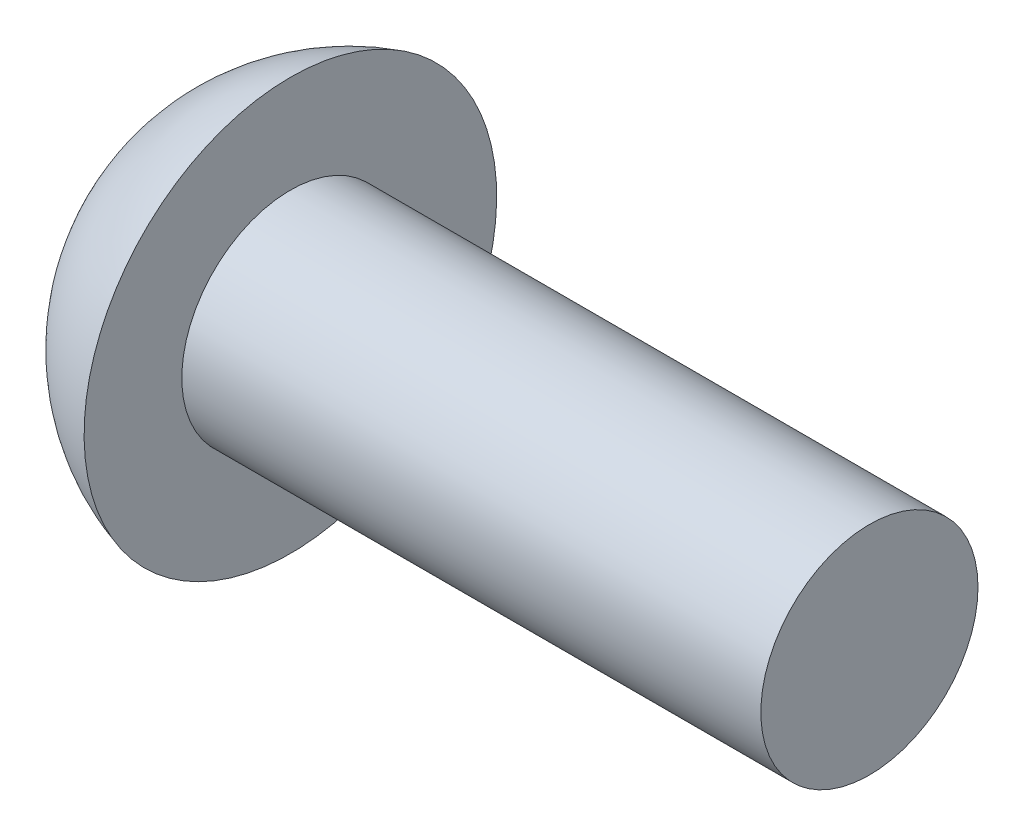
ISO-10303-21;
HEADER;
FILE_DESCRIPTION(('STEP AP214'),'2;1');
FILE_NAME('part.step','',(''),(''),'','','');
FILE_SCHEMA(('AUTOMOTIVE_DESIGN { 1 0 10303 214 1 1 1 1 }'));
ENDSEC;
DATA;
#1=APPLICATION_CONTEXT('core data for automotive mechanical design processes');
#2=APPLICATION_PROTOCOL_DEFINITION('international standard','automotive_design',2000,#1);
#3=PRODUCT_CONTEXT('',#1,'mechanical');
#4=PRODUCT('Part','Part','',(#3));
#5=PRODUCT_RELATED_PRODUCT_CATEGORY('part','',(#4));
#6=PRODUCT_DEFINITION_FORMATION('','',#4);
#7=PRODUCT_DEFINITION_CONTEXT('part definition',#1,'design');
#8=PRODUCT_DEFINITION('design','',#6,#7);
#9=PRODUCT_DEFINITION_SHAPE('','',#8);
#10=(LENGTH_UNIT() NAMED_UNIT(*) SI_UNIT(.MILLI.,.METRE.));
#11=(NAMED_UNIT(*) PLANE_ANGLE_UNIT() SI_UNIT($,.RADIAN.));
#12=(NAMED_UNIT(*) SI_UNIT($,.STERADIAN.) SOLID_ANGLE_UNIT());
#13=UNCERTAINTY_MEASURE_WITH_UNIT(LENGTH_MEASURE(1.E-05),#10,'distance_accuracy_value','');
#14=(GEOMETRIC_REPRESENTATION_CONTEXT(3) GLOBAL_UNCERTAINTY_ASSIGNED_CONTEXT((#13)) GLOBAL_UNIT_ASSIGNED_CONTEXT((#10,
#11,#12)) REPRESENTATION_CONTEXT('',''));
#15=CARTESIAN_POINT('',(0.,0.,0.));
#16=DIRECTION('',(0.,0.,1.));
#17=DIRECTION('',(1.,0.,0.));
#18=AXIS2_PLACEMENT_3D('',#15,#16,#17);
#19=CARTESIAN_POINT('',(0.,0.,0.));
#20=DIRECTION('',(1.,0.,0.));
#21=DIRECTION('',(0.,0.,-1.));
#22=AXIS2_PLACEMENT_3D('',#19,#20,#21);
#23=PLANE('',#22);
#24=CARTESIAN_POINT('',(0.,0.,0.));
#25=DIRECTION('',(-1.,0.,0.));
#26=DIRECTION('',(0.,0.,1.));
#27=AXIS2_PLACEMENT_3D('',#24,#25,#26);
#28=CIRCLE('',#27,1.65);
#29=CARTESIAN_POINT('',(0.,1.65,0.));
#30=VERTEX_POINT('',#29);
#31=EDGE_CURVE('E104',#30,#30,#28,.T.);
#32=ORIENTED_EDGE('',*,*,#31,.T.);
#33=EDGE_LOOP('',(#32));
#34=FACE_BOUND('',#33,.T.);
#35=DIRECTION('',(0.,0.866025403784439,-0.5));
#36=VECTOR('',#35,1.);
#37=CARTESIAN_POINT('',(0.,-1.,-0.57735026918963));
#38=LINE('',#37,#36);
#39=CARTESIAN_POINT('',(0.,-1.,-0.57735026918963));
#40=VERTEX_POINT('',#39);
#41=CARTESIAN_POINT('',(0.,0.,-1.15470053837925));
#42=VERTEX_POINT('',#41);
#43=EDGE_CURVE('E30',#40,#42,#38,.T.);
#44=ORIENTED_EDGE('',*,*,#43,.T.);
#45=DIRECTION('',(0.,0.866025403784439,0.5));
#46=VECTOR('',#45,1.);
#47=CARTESIAN_POINT('',(0.,0.,-1.15470053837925));
#48=LINE('',#47,#46);
#49=CARTESIAN_POINT('',(0.,1.,-0.577350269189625));
#50=VERTEX_POINT('',#49);
#51=EDGE_CURVE('E89',#42,#50,#48,.T.);
#52=ORIENTED_EDGE('',*,*,#51,.T.);
#53=DIRECTION('',(0.,0.,1.));
#54=VECTOR('',#53,1.);
#55=CARTESIAN_POINT('',(0.,1.,-0.577350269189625));
#56=LINE('',#55,#54);
#57=CARTESIAN_POINT('',(0.,1.,0.577350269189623));
#58=VERTEX_POINT('',#57);
#59=EDGE_CURVE('E87',#50,#58,#56,.T.);
#60=ORIENTED_EDGE('',*,*,#59,.T.);
#61=DIRECTION('',(0.,-0.866025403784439,0.5));
#62=VECTOR('',#61,1.);
#63=CARTESIAN_POINT('',(0.,1.,0.577350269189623));
#64=LINE('',#63,#62);
#65=CARTESIAN_POINT('',(0.,0.,1.15470053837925));
#66=VERTEX_POINT('',#65);
#67=EDGE_CURVE('E66',#58,#66,#64,.T.);
#68=ORIENTED_EDGE('',*,*,#67,.T.);
#69=DIRECTION('',(0.,-0.866025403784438,-0.5));
#70=VECTOR('',#69,1.);
#71=CARTESIAN_POINT('',(0.,0.,1.15470053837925));
#72=LINE('',#71,#70);
#73=CARTESIAN_POINT('',(0.,-1.,0.577350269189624));
#74=VERTEX_POINT('',#73);
#75=EDGE_CURVE('E77',#66,#74,#72,.T.);
#76=ORIENTED_EDGE('',*,*,#75,.T.);
#77=DIRECTION('',(0.,0.,-1.));
#78=VECTOR('',#77,1.);
#79=CARTESIAN_POINT('',(0.,-1.,0.577350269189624));
#80=LINE('',#79,#78);
#81=EDGE_CURVE('E83',#74,#40,#80,.T.);
#82=ORIENTED_EDGE('',*,*,#81,.T.);
#83=EDGE_LOOP('',(#44,#52,#60,#68,#76,#82));
#84=FACE_BOUND('',#83,.T.);
#85=ADVANCED_FACE('F16',(#34,#84),#23,.F.);
#86=CARTESIAN_POINT('',(1.65,0.,0.));
#87=DIRECTION('',(1.,0.,0.));
#88=DIRECTION('',(0.,0.,-1.));
#89=AXIS2_PLACEMENT_3D('',#86,#87,#88);
#90=PLANE('',#89);
#91=CARTESIAN_POINT('',(1.65,0.,0.));
#92=DIRECTION('',(-1.,0.,0.));
#93=DIRECTION('',(0.,0.,1.));
#94=AXIS2_PLACEMENT_3D('',#91,#92,#93);
#95=CIRCLE('',#94,2.85);
#96=CARTESIAN_POINT('',(1.65,2.85,0.));
#97=VERTEX_POINT('',#96);
#98=EDGE_CURVE('E107',#97,#97,#95,.T.);
#99=ORIENTED_EDGE('',*,*,#98,.F.);
#100=EDGE_LOOP('',(#99));
#101=FACE_BOUND('',#100,.T.);
#102=CARTESIAN_POINT('',(1.65,0.,0.));
#103=DIRECTION('',(1.,0.,0.));
#104=DIRECTION('',(0.,0.,-1.));
#105=AXIS2_PLACEMENT_3D('',#102,#103,#104);
#106=CIRCLE('',#105,1.5);
#107=CARTESIAN_POINT('',(1.65,0.,-1.5));
#108=VERTEX_POINT('',#107);
#109=EDGE_CURVE('E19',#108,#108,#106,.T.);
#110=ORIENTED_EDGE('',*,*,#109,.F.);
#111=EDGE_LOOP('',(#110));
#112=FACE_BOUND('',#111,.T.);
#113=ADVANCED_FACE('F120',(#101,#112),#90,.T.);
#114=CARTESIAN_POINT('',(9.65,0.,0.));
#115=DIRECTION('',(-1.,0.,0.));
#116=DIRECTION('',(0.,0.,1.));
#117=AXIS2_PLACEMENT_3D('',#114,#115,#116);
#118=CYLINDRICAL_SURFACE('',#117,1.5);
#119=CARTESIAN_POINT('',(9.65,0.,0.));
#120=DIRECTION('',(1.,0.,0.));
#121=DIRECTION('',(0.,0.,-1.));
#122=AXIS2_PLACEMENT_3D('',#119,#120,#121);
#123=CIRCLE('',#122,1.5);
#124=CARTESIAN_POINT('',(9.65,0.,-1.5));
#125=VERTEX_POINT('',#124);
#126=EDGE_CURVE('E11',#125,#125,#123,.T.);
#127=ORIENTED_EDGE('',*,*,#126,.F.);
#128=EDGE_LOOP('',(#127));
#129=FACE_BOUND('',#128,.T.);
#130=ORIENTED_EDGE('',*,*,#109,.T.);
#131=EDGE_LOOP('',(#130));
#132=FACE_BOUND('',#131,.T.);
#133=ADVANCED_FACE('F118',(#129,#132),#118,.T.);
#134=CARTESIAN_POINT('',(9.65,0.,0.));
#135=DIRECTION('',(1.,0.,0.));
#136=DIRECTION('',(0.,0.,-1.));
#137=AXIS2_PLACEMENT_3D('',#134,#135,#136);
#138=PLANE('',#137);
#139=ORIENTED_EDGE('',*,*,#126,.T.);
#140=EDGE_LOOP('',(#139));
#141=FACE_BOUND('',#140,.T.);
#142=ADVANCED_FACE('F128',(#141),#138,.T.);
#143=CARTESIAN_POINT('',(2.46136363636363,0.,0.));
#144=DIRECTION('',(-1.,0.,0.));
#145=DIRECTION('',(0.,1.,0.));
#146=AXIS2_PLACEMENT_3D('',#143,#144,#145);
#147=SPHERICAL_SURFACE('',#146,2.96324331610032);
#148=CARTESIAN_POINT('',(1.65,2.85,0.));
#149=CARTESIAN_POINT('',(1.6291329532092,2.84405942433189,0.));
#150=CARTESIAN_POINT('',(1.60833117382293,2.83788959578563,0.));
#151=CARTESIAN_POINT('',(1.56686813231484,2.82509458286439,0.));
#152=CARTESIAN_POINT('',(1.54620687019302,2.81846939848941,0.));
#153=CARTESIAN_POINT('',(1.50503484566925,2.80476682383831,0.));
#154=CARTESIAN_POINT('',(1.48452408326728,2.79768943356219,0.));
#155=CARTESIAN_POINT('',(1.44366294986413,2.78308587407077,0.));
#156=CARTESIAN_POINT('',(1.42331257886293,2.77555970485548,0.));
#157=CARTESIAN_POINT('',(1.38278204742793,2.7600622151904,0.));
#158=CARTESIAN_POINT('',(1.36260188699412,2.75209089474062,0.));
#159=CARTESIAN_POINT('',(1.32242151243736,2.73570694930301,0.));
#160=CARTESIAN_POINT('',(1.30242129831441,2.72729432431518,0.));
#161=CARTESIAN_POINT('',(1.26261046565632,2.71003182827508,0.));
#162=CARTESIAN_POINT('',(1.24279984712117,2.70118195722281,0.));
#163=CARTESIAN_POINT('',(1.20337776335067,2.68304923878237,0.));
#164=CARTESIAN_POINT('',(1.1837662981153,2.67376639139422,0.));
#165=CARTESIAN_POINT('',(1.1447519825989,2.65477219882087,0.));
#166=CARTESIAN_POINT('',(1.12534913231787,2.64506085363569,0.));
#167=CARTESIAN_POINT('',(1.08676140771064,2.62521435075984,0.));
#168=CARTESIAN_POINT('',(1.06757653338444,2.61507919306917,0.));
#169=CARTESIAN_POINT('',(1.02943401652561,2.59438995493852,0.));
#170=CARTESIAN_POINT('',(1.01047637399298,2.58383587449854,0.));
#171=CARTESIAN_POINT('',(0.972797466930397,2.56231388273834,0.));
#172=CARTESIAN_POINT('',(0.95407620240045,2.55134597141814,0.));
#173=CARTESIAN_POINT('',(0.916879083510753,2.52900160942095,0.));
#174=CARTESIAN_POINT('',(0.898403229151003,2.51762515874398,0.));
#175=CARTESIAN_POINT('',(0.861705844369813,2.49446920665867,0.));
#176=CARTESIAN_POINT('',(0.843484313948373,2.48268970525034,0.));
#177=CARTESIAN_POINT('',(0.807304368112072,2.45873333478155,0.));
#178=CARTESIAN_POINT('',(0.789345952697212,2.44655646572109,0.));
#179=CARTESIAN_POINT('',(0.75370090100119,2.42181123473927,0.));
#180=CARTESIAN_POINT('',(0.736014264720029,2.40924287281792,0.));
#181=CARTESIAN_POINT('',(0.700921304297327,2.38372071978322,0.));
#182=CARTESIAN_POINT('',(0.683514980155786,2.37076692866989,0.));
#183=CARTESIAN_POINT('',(0.648991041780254,2.3444801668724,0.));
#184=CARTESIAN_POINT('',(0.631873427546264,2.33114719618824,0.));
#185=CARTESIAN_POINT('',(0.59793516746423,2.30410850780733,0.));
#186=CARTESIAN_POINT('',(0.581114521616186,2.29040279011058,0.));
#187=CARTESIAN_POINT('',(0.547778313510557,2.26262522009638,0.));
#188=CARTESIAN_POINT('',(0.53126275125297,2.24855336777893,0.));
#189=CARTESIAN_POINT('',(0.49854467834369,2.22005031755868,0.));
#190=CARTESIAN_POINT('',(0.482342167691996,2.20561911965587,0.));
#191=CARTESIAN_POINT('',(0.450258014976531,2.17640434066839,0.));
#192=CARTESIAN_POINT('',(0.43437637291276,2.16162075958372,0.));
#193=CARTESIAN_POINT('',(0.402941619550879,2.13170834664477,0.));
#194=CARTESIAN_POINT('',(0.387388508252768,2.11657951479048,0.));
#195=CARTESIAN_POINT('',(0.356618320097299,2.08598389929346,0.));
#196=CARTESIAN_POINT('',(0.341401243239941,2.07051711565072,0.));
#197=CARTESIAN_POINT('',(0.311310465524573,2.03925305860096,0.));
#198=CARTESIAN_POINT('',(0.296436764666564,2.02345578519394,0.));
#199=CARTESIAN_POINT('',(0.267039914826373,1.99153837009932,0.));
#200=CARTESIAN_POINT('',(0.252516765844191,1.97541822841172,0.));
#201=CARTESIAN_POINT('',(0.223828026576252,1.94286285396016,0.));
#202=CARTESIAN_POINT('',(0.209662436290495,1.9264276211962,0.));
#203=CARTESIAN_POINT('',(0.1816956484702,1.89324999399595,0.));
#204=CARTESIAN_POINT('',(0.167894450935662,1.87650759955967,0.));
#205=CARTESIAN_POINT('',(0.14066310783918,1.84272372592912,0.));
#206=CARTESIAN_POINT('',(0.127232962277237,1.82568224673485,0.));
#207=CARTESIAN_POINT('',(0.100750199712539,1.79130842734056,0.));
#208=CARTESIAN_POINT('',(0.0876975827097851,1.77397608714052,0.));
#209=CARTESIAN_POINT('',(0.0619761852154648,1.73902890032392,0.));
#210=CARTESIAN_POINT('',(0.0493074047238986,1.72141405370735,0.));
#211=CARTESIAN_POINT('',(0.0243597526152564,1.68591038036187,0.));
#212=CARTESIAN_POINT('',(0.0120808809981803,1.66802155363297,0.));
#213=CARTESIAN_POINT('',(0.,1.65,0.));
#214=B_SPLINE_CURVE_WITH_KNOTS('',3,(#148,#149,#150,#151,#152,#153,#154,#155,#156,#157,#158,
#159,#160,#161,#162,#163,#164,#165,#166,#167,#168,#169,#170,#171,#172,#173,#174,#175,#176,#177,
#178,#179,#180,#181,#182,#183,#184,#185,#186,#187,#188,#189,#190,#191,#192,#193,#194,#195,#196,
#197,#198,#199,#200,#201,#202,#203,#204,#205,#206,#207,#208,#209,#210,#211,#212,#213),
.UNSPECIFIED.,.F.,.F.,(4,2,2,2,2,2,2,2,2,2,2,2,2,2,2,2,2,2,2,2,2,2,2,2,2,2,2,2,2,2,2,2,4),(0.,
0.0650872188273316,0.130174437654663,0.195261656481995,0.260348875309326,0.325436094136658,
0.390523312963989,0.455610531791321,0.520697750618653,0.585784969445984,0.650872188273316,
0.715959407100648,0.781046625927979,0.846133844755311,0.911221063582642,0.976308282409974,
1.04139550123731,1.10648272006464,1.17156993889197,1.2366571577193,1.30174437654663,
1.36683159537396,1.4319188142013,1.49700603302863,1.56209325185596,1.62718047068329,
1.69226768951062,1.75735490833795,1.82244212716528,1.88752934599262,1.95261656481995,
2.01770378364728,2.08279100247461),.UNSPECIFIED.);
#215=EDGE_CURVE('BSEAM135',#97,#30,#214,.T.);
#216=ORIENTED_EDGE('',*,*,#98,.T.);
#217=ORIENTED_EDGE('',*,*,#31,.F.);
#218=ORIENTED_EDGE('',*,*,#215,.T.);
#219=ORIENTED_EDGE('',*,*,#215,.F.);
#220=EDGE_LOOP('',(#216,#218,#217,#219));
#221=FACE_BOUND('',#220,.T.);
#222=ADVANCED_FACE('F135',(#221),#147,.T.);
#223=CARTESIAN_POINT('',(1.04,-1.,-0.57735026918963));
#224=DIRECTION('',(0.,0.5,0.866025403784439));
#225=DIRECTION('',(0.,-0.866025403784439,0.5));
#226=AXIS2_PLACEMENT_3D('',#223,#224,#225);
#227=PLANE('',#226);
#228=ORIENTED_EDGE('',*,*,#43,.F.);
#229=DIRECTION('',(-1.,0.,0.));
#230=VECTOR('',#229,1.);
#231=CARTESIAN_POINT('',(1.04,-1.,-0.57735026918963));
#232=LINE('',#231,#230);
#233=CARTESIAN_POINT('',(1.04,-1.,-0.57735026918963));
#234=VERTEX_POINT('',#233);
#235=EDGE_CURVE('E95',#234,#40,#232,.T.);
#236=ORIENTED_EDGE('',*,*,#235,.F.);
#237=DIRECTION('',(0.,0.866025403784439,-0.5));
#238=VECTOR('',#237,1.);
#239=CARTESIAN_POINT('',(1.04,-1.,-0.57735026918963));
#240=LINE('',#239,#238);
#241=CARTESIAN_POINT('',(1.04,0.,-1.15470053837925));
#242=VERTEX_POINT('',#241);
#243=EDGE_CURVE('E94',#234,#242,#240,.T.);
#244=ORIENTED_EDGE('',*,*,#243,.T.);
#245=DIRECTION('',(-1.,0.,0.));
#246=VECTOR('',#245,1.);
#247=CARTESIAN_POINT('',(1.04,0.,-1.15470053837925));
#248=LINE('',#247,#246);
#249=EDGE_CURVE('E102',#242,#42,#248,.T.);
#250=ORIENTED_EDGE('',*,*,#249,.T.);
#251=EDGE_LOOP('',(#228,#236,#244,#250));
#252=FACE_BOUND('',#251,.T.);
#253=ADVANCED_FACE('F139',(#252),#227,.T.);
#254=CARTESIAN_POINT('',(1.04,0.,-1.15470053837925));
#255=DIRECTION('',(0.,-0.5,0.866025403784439));
#256=DIRECTION('',(0.,-0.866025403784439,-0.5));
#257=AXIS2_PLACEMENT_3D('',#254,#255,#256);
#258=PLANE('',#257);
#259=ORIENTED_EDGE('',*,*,#51,.F.);
#260=ORIENTED_EDGE('',*,*,#249,.F.);
#261=DIRECTION('',(0.,0.866025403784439,0.5));
#262=VECTOR('',#261,1.);
#263=CARTESIAN_POINT('',(1.04,0.,-1.15470053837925));
#264=LINE('',#263,#262);
#265=CARTESIAN_POINT('',(1.04,1.,-0.577350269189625));
#266=VERTEX_POINT('',#265);
#267=EDGE_CURVE('E210',#242,#266,#264,.T.);
#268=ORIENTED_EDGE('',*,*,#267,.T.);
#269=DIRECTION('',(-1.,0.,0.));
#270=VECTOR('',#269,1.);
#271=CARTESIAN_POINT('',(1.04,1.,-0.577350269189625));
#272=LINE('',#271,#270);
#273=EDGE_CURVE('E100',#266,#50,#272,.T.);
#274=ORIENTED_EDGE('',*,*,#273,.T.);
#275=EDGE_LOOP('',(#259,#260,#268,#274));
#276=FACE_BOUND('',#275,.T.);
#277=ADVANCED_FACE('F142',(#276),#258,.T.);
#278=CARTESIAN_POINT('',(1.04,1.,-0.577350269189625));
#279=DIRECTION('',(0.,-1.,0.));
#280=DIRECTION('',(0.,0.,-1.));
#281=AXIS2_PLACEMENT_3D('',#278,#279,#280);
#282=PLANE('',#281);
#283=ORIENTED_EDGE('',*,*,#59,.F.);
#284=ORIENTED_EDGE('',*,*,#273,.F.);
#285=DIRECTION('',(0.,0.,1.));
#286=VECTOR('',#285,1.);
#287=CARTESIAN_POINT('',(1.04,1.,-0.577350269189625));
#288=LINE('',#287,#286);
#289=CARTESIAN_POINT('',(1.04,1.,0.577350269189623));
#290=VERTEX_POINT('',#289);
#291=EDGE_CURVE('E39',#266,#290,#288,.T.);
#292=ORIENTED_EDGE('',*,*,#291,.T.);
#293=DIRECTION('',(-1.,0.,0.));
#294=VECTOR('',#293,1.);
#295=CARTESIAN_POINT('',(1.04,1.,0.577350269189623));
#296=LINE('',#295,#294);
#297=EDGE_CURVE('E73',#290,#58,#296,.T.);
#298=ORIENTED_EDGE('',*,*,#297,.T.);
#299=EDGE_LOOP('',(#283,#284,#292,#298));
#300=FACE_BOUND('',#299,.T.);
#301=ADVANCED_FACE('F145',(#300),#282,.T.);
#302=CARTESIAN_POINT('',(1.04,1.,0.577350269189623));
#303=DIRECTION('',(0.,-0.5,-0.866025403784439));
#304=DIRECTION('',(0.,0.866025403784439,-0.5));
#305=AXIS2_PLACEMENT_3D('',#302,#303,#304);
#306=PLANE('',#305);
#307=ORIENTED_EDGE('',*,*,#67,.F.);
#308=ORIENTED_EDGE('',*,*,#297,.F.);
#309=DIRECTION('',(0.,-0.866025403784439,0.5));
#310=VECTOR('',#309,1.);
#311=CARTESIAN_POINT('',(1.04,1.,0.577350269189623));
#312=LINE('',#311,#310);
#313=CARTESIAN_POINT('',(1.04,0.,1.15470053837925));
#314=VERTEX_POINT('',#313);
#315=EDGE_CURVE('E70',#290,#314,#312,.T.);
#316=ORIENTED_EDGE('',*,*,#315,.T.);
#317=DIRECTION('',(-1.,0.,0.));
#318=VECTOR('',#317,1.);
#319=CARTESIAN_POINT('',(1.04,0.,1.15470053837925));
#320=LINE('',#319,#318);
#321=EDGE_CURVE('E61',#314,#66,#320,.T.);
#322=ORIENTED_EDGE('',*,*,#321,.T.);
#323=EDGE_LOOP('',(#307,#308,#316,#322));
#324=FACE_BOUND('',#323,.T.);
#325=ADVANCED_FACE('F63',(#324),#306,.T.);
#326=CARTESIAN_POINT('',(1.04,0.,1.15470053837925));
#327=DIRECTION('',(0.,0.5,-0.866025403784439));
#328=DIRECTION('',(0.,0.866025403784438,0.5));
#329=AXIS2_PLACEMENT_3D('',#326,#327,#328);
#330=PLANE('',#329);
#331=ORIENTED_EDGE('',*,*,#75,.F.);
#332=ORIENTED_EDGE('',*,*,#321,.F.);
#333=DIRECTION('',(0.,-0.866025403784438,-0.5));
#334=VECTOR('',#333,1.);
#335=CARTESIAN_POINT('',(1.04,0.,1.15470053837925));
#336=LINE('',#335,#334);
#337=CARTESIAN_POINT('',(1.04,-1.,0.577350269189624));
#338=VERTEX_POINT('',#337);
#339=EDGE_CURVE('E185',#314,#338,#336,.T.);
#340=ORIENTED_EDGE('',*,*,#339,.T.);
#341=DIRECTION('',(-1.,0.,0.));
#342=VECTOR('',#341,1.);
#343=CARTESIAN_POINT('',(1.04,-1.,0.577350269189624));
#344=LINE('',#343,#342);
#345=EDGE_CURVE('E74',#338,#74,#344,.T.);
#346=ORIENTED_EDGE('',*,*,#345,.T.);
#347=EDGE_LOOP('',(#331,#332,#340,#346));
#348=FACE_BOUND('',#347,.T.);
#349=ADVANCED_FACE('F78',(#348),#330,.T.);
#350=CARTESIAN_POINT('',(1.04,-1.,0.577350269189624));
#351=DIRECTION('',(0.,1.,0.));
#352=DIRECTION('',(0.,0.,1.));
#353=AXIS2_PLACEMENT_3D('',#350,#351,#352);
#354=PLANE('',#353);
#355=ORIENTED_EDGE('',*,*,#81,.F.);
#356=ORIENTED_EDGE('',*,*,#345,.F.);
#357=DIRECTION('',(0.,0.,-1.));
#358=VECTOR('',#357,1.);
#359=CARTESIAN_POINT('',(1.04,-1.,0.577350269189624));
#360=LINE('',#359,#358);
#361=EDGE_CURVE('E97',#338,#234,#360,.T.);
#362=ORIENTED_EDGE('',*,*,#361,.T.);
#363=ORIENTED_EDGE('',*,*,#235,.T.);
#364=EDGE_LOOP('',(#355,#356,#362,#363));
#365=FACE_BOUND('',#364,.T.);
#366=ADVANCED_FACE('F154',(#365),#354,.T.);
#367=CARTESIAN_POINT('',(1.04,0.,1.15470053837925));
#368=DIRECTION('',(0.86602540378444,-0.25,0.433012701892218));
#369=DIRECTION('',(0.447213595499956,0.,-0.894427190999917));
#370=AXIS2_PLACEMENT_3D('',#367,#368,#369);
#371=PLANE('',#370);
#372=ORIENTED_EDGE('',*,*,#339,.F.);
#373=DIRECTION('',(-0.447213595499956,0.,0.894427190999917));
#374=VECTOR('',#373,1.);
#375=CARTESIAN_POINT('',(1.04,0.,1.15470053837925));
#376=LINE('',#375,#374);
#377=CARTESIAN_POINT('',(1.61735026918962,0.,0.));
#378=VERTEX_POINT('',#377);
#379=EDGE_CURVE('E187',#378,#314,#376,.T.);
#380=ORIENTED_EDGE('',*,*,#379,.F.);
#381=DIRECTION('',(-0.447213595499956,-0.774596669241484,0.447213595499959));
#382=VECTOR('',#381,1.);
#383=CARTESIAN_POINT('',(1.04,-1.,0.577350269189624));
#384=LINE('',#383,#382);
#385=EDGE_CURVE('E190',#378,#338,#384,.T.);
#386=ORIENTED_EDGE('',*,*,#385,.T.);
#387=EDGE_LOOP('',(#372,#380,#386));
#388=FACE_BOUND('',#387,.T.);
#389=ADVANCED_FACE('F157',(#388),#371,.F.);
#390=CARTESIAN_POINT('',(1.04,-1.,0.577350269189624));
#391=DIRECTION('',(0.86602540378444,-0.5,0.));
#392=DIRECTION('',(0.5,0.86602540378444,0.));
#393=AXIS2_PLACEMENT_3D('',#390,#391,#392);
#394=PLANE('',#393);
#395=ORIENTED_EDGE('',*,*,#361,.F.);
#396=ORIENTED_EDGE('',*,*,#385,.F.);
#397=DIRECTION('',(-0.447213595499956,-0.774596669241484,-0.447213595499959));
#398=VECTOR('',#397,1.);
#399=CARTESIAN_POINT('',(1.04,-1.,-0.57735026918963));
#400=LINE('',#399,#398);
#401=EDGE_CURVE('E214',#378,#234,#400,.T.);
#402=ORIENTED_EDGE('',*,*,#401,.T.);
#403=EDGE_LOOP('',(#395,#396,#402));
#404=FACE_BOUND('',#403,.T.);
#405=ADVANCED_FACE('F159',(#404),#394,.F.);
#406=CARTESIAN_POINT('',(1.04,-1.,-0.57735026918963));
#407=DIRECTION('',(0.86602540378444,-0.25,-0.433012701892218));
#408=DIRECTION('',(-0.447213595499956,0.,-0.894427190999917));
#409=AXIS2_PLACEMENT_3D('',#406,#407,#408);
#410=PLANE('',#409);
#411=ORIENTED_EDGE('',*,*,#243,.F.);
#412=ORIENTED_EDGE('',*,*,#401,.F.);
#413=DIRECTION('',(-0.447213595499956,0.,-0.894427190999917));
#414=VECTOR('',#413,1.);
#415=CARTESIAN_POINT('',(1.04,0.,-1.15470053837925));
#416=LINE('',#415,#414);
#417=EDGE_CURVE('E222',#378,#242,#416,.T.);
#418=ORIENTED_EDGE('',*,*,#417,.T.);
#419=EDGE_LOOP('',(#411,#412,#418));
#420=FACE_BOUND('',#419,.T.);
#421=ADVANCED_FACE('F162',(#420),#410,.F.);
#422=CARTESIAN_POINT('',(1.04,0.,-1.15470053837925));
#423=DIRECTION('',(0.86602540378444,0.25,-0.433012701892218));
#424=DIRECTION('',(-0.447213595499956,0.,-0.894427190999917));
#425=AXIS2_PLACEMENT_3D('',#422,#423,#424);
#426=PLANE('',#425);
#427=ORIENTED_EDGE('',*,*,#267,.F.);
#428=ORIENTED_EDGE('',*,*,#417,.F.);
#429=DIRECTION('',(-0.447213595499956,0.774596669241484,-0.447213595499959));
#430=VECTOR('',#429,1.);
#431=CARTESIAN_POINT('',(1.04,1.,-0.577350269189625));
#432=LINE('',#431,#430);
#433=EDGE_CURVE('E224',#378,#266,#432,.T.);
#434=ORIENTED_EDGE('',*,*,#433,.T.);
#435=EDGE_LOOP('',(#427,#428,#434));
#436=FACE_BOUND('',#435,.T.);
#437=ADVANCED_FACE('F166',(#436),#426,.F.);
#438=CARTESIAN_POINT('',(1.04,1.,-0.577350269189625));
#439=DIRECTION('',(0.86602540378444,0.5,0.));
#440=DIRECTION('',(-0.5,0.86602540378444,0.));
#441=AXIS2_PLACEMENT_3D('',#438,#439,#440);
#442=PLANE('',#441);
#443=ORIENTED_EDGE('',*,*,#291,.F.);
#444=ORIENTED_EDGE('',*,*,#433,.F.);
#445=DIRECTION('',(-0.447213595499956,0.774596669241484,0.447213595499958));
#446=VECTOR('',#445,1.);
#447=CARTESIAN_POINT('',(1.04,1.,0.577350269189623));
#448=LINE('',#447,#446);
#449=EDGE_CURVE('E218',#378,#290,#448,.T.);
#450=ORIENTED_EDGE('',*,*,#449,.T.);
#451=EDGE_LOOP('',(#443,#444,#450));
#452=FACE_BOUND('',#451,.T.);
#453=ADVANCED_FACE('F170',(#452),#442,.F.);
#454=CARTESIAN_POINT('',(1.04,1.,0.577350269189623));
#455=DIRECTION('',(0.86602540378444,0.25,0.433012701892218));
#456=DIRECTION('',(0.447213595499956,0.,-0.894427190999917));
#457=AXIS2_PLACEMENT_3D('',#454,#455,#456);
#458=PLANE('',#457);
#459=ORIENTED_EDGE('',*,*,#315,.F.);
#460=ORIENTED_EDGE('',*,*,#449,.F.);
#461=ORIENTED_EDGE('',*,*,#379,.T.);
#462=EDGE_LOOP('',(#459,#460,#461));
#463=FACE_BOUND('',#462,.T.);
#464=ADVANCED_FACE('F174',(#463),#458,.F.);
#465=CLOSED_SHELL('',(#85,#113,#133,#142,#222,#253,#277,#301,#325,#349,#366,#389,#405,#421,#437,
#453,#464));
#466=MANIFOLD_SOLID_BREP('B1',#465);
#467=ADVANCED_BREP_SHAPE_REPRESENTATION('',(#18,#466),#14);
#468=SHAPE_DEFINITION_REPRESENTATION(#9,#467);
ENDSEC;
END-ISO-10303-21;
